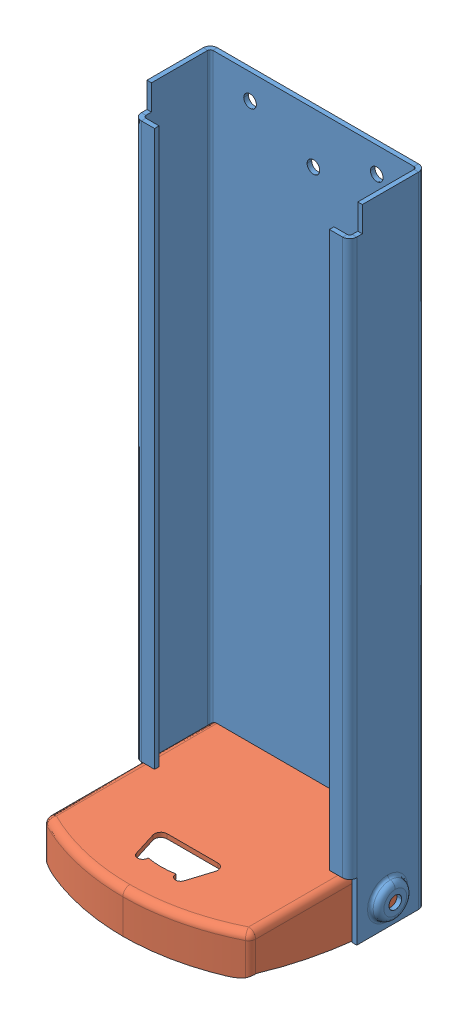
SolidWorks assembly Base fixe.SLDASM, configuration Défaut (file format 14000). Lengths in mm.
Overall size (91 252.96 77).
2 component instances, 2 part files, 3 mates.
Components (placement in the parent):
- Socle-1: Socle.SLDPRT [Défaut] at origin size (91 252 30)
- Appui fixe-1: Appui fixe.SLDPRT [Défaut] at (0 23 2) size (81.41 23.96 75)
Mates (geometry in assembly coordinates):
- Coaxiale1: concentric: cylinder of Socle-1 through (-45.5 10 15) axis (1 0 0) radius 2.5; cylinder of Appui fixe-1 through (40.7 10 15) axis (-1 0 0) radius 2.5
- Coïncidente1: coincident: plane of Socle-1 through (-40.7 252 0) normal (1 0 0); plane of Appui fixe-1 through (-40.7 -1 2) normal (-1 0 0)
- Perpendiculaire1: perpendicular: plane of Socle-1 through (-42.5 252 1.8) normal (0 0 1); plane of Appui fixe-1 through (0 23 -10.8245) normal (0 1 0)
